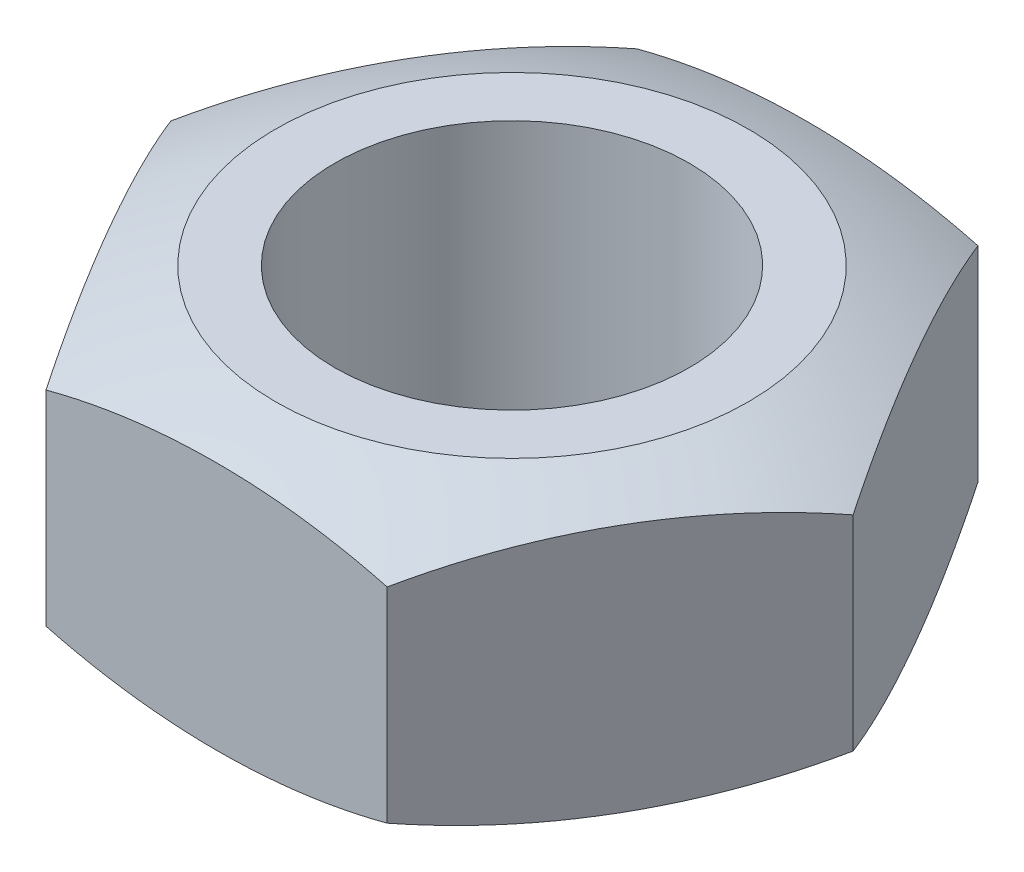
ISO-10303-21;
HEADER;
FILE_DESCRIPTION(('STEP AP214'),'2;1');
FILE_NAME('part.step','',(''),(''),'','','');
FILE_SCHEMA(('AUTOMOTIVE_DESIGN { 1 0 10303 214 1 1 1 1 }'));
ENDSEC;
DATA;
#1=APPLICATION_CONTEXT('core data for automotive mechanical design processes');
#2=APPLICATION_PROTOCOL_DEFINITION('international standard','automotive_design',2000,#1);
#3=PRODUCT_CONTEXT('',#1,'mechanical');
#4=PRODUCT('Part','Part','',(#3));
#5=PRODUCT_RELATED_PRODUCT_CATEGORY('part','',(#4));
#6=PRODUCT_DEFINITION_FORMATION('','',#4);
#7=PRODUCT_DEFINITION_CONTEXT('part definition',#1,'design');
#8=PRODUCT_DEFINITION('design','',#6,#7);
#9=PRODUCT_DEFINITION_SHAPE('','',#8);
#10=(LENGTH_UNIT() NAMED_UNIT(*) SI_UNIT(.MILLI.,.METRE.));
#11=(NAMED_UNIT(*) PLANE_ANGLE_UNIT() SI_UNIT($,.RADIAN.));
#12=(NAMED_UNIT(*) SI_UNIT($,.STERADIAN.) SOLID_ANGLE_UNIT());
#13=UNCERTAINTY_MEASURE_WITH_UNIT(LENGTH_MEASURE(1.E-05),#10,'distance_accuracy_value','');
#14=(GEOMETRIC_REPRESENTATION_CONTEXT(3) GLOBAL_UNCERTAINTY_ASSIGNED_CONTEXT((#13)) GLOBAL_UNIT_ASSIGNED_CONTEXT((#10,
#11,#12)) REPRESENTATION_CONTEXT('',''));
#15=CARTESIAN_POINT('',(0.,0.,0.));
#16=DIRECTION('',(0.,0.,1.));
#17=DIRECTION('',(1.,0.,0.));
#18=AXIS2_PLACEMENT_3D('',#15,#16,#17);
#19=CARTESIAN_POINT('',(5.77350269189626,5.,0.));
#20=DIRECTION('',(0.,1.,0.));
#21=DIRECTION('',(0.,0.,1.));
#22=AXIS2_PLACEMENT_3D('',#19,#20,#21);
#23=PLANE('',#22);
#24=CARTESIAN_POINT('',(0.,5.,0.));
#25=DIRECTION('',(0.,1.,0.));
#26=DIRECTION('',(0.,0.,1.));
#27=AXIS2_PLACEMENT_3D('',#24,#25,#26);
#28=CIRCLE('',#27,4.);
#29=CARTESIAN_POINT('',(0.,5.,4.));
#30=VERTEX_POINT('',#29);
#31=EDGE_CURVE('E40',#30,#30,#28,.F.);
#32=ORIENTED_EDGE('',*,*,#31,.F.);
#33=EDGE_LOOP('',(#32));
#34=FACE_BOUND('',#33,.T.);
#35=CARTESIAN_POINT('',(0.,5.,0.));
#36=DIRECTION('',(0.,1.,0.));
#37=DIRECTION('',(0.,0.,1.));
#38=AXIS2_PLACEMENT_3D('',#35,#36,#37);
#39=CIRCLE('',#38,3.);
#40=CARTESIAN_POINT('',(0.,5.,3.));
#41=VERTEX_POINT('',#40);
#42=EDGE_CURVE('E142',#41,#41,#39,.T.);
#43=ORIENTED_EDGE('',*,*,#42,.F.);
#44=EDGE_LOOP('',(#43));
#45=FACE_BOUND('',#44,.T.);
#46=ADVANCED_FACE('F36',(#34,#45),#23,.T.);
#47=CARTESIAN_POINT('',(5.77350269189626,0.,0.));
#48=DIRECTION('',(0.,1.,0.));
#49=DIRECTION('',(0.,0.,1.));
#50=AXIS2_PLACEMENT_3D('',#47,#48,#49);
#51=PLANE('',#50);
#52=CARTESIAN_POINT('',(0.,0.,0.));
#53=DIRECTION('',(0.,1.,0.));
#54=DIRECTION('',(0.,0.,1.));
#55=AXIS2_PLACEMENT_3D('',#52,#53,#54);
#56=CIRCLE('',#55,4.);
#57=CARTESIAN_POINT('',(0.,0.,4.));
#58=VERTEX_POINT('',#57);
#59=EDGE_CURVE('E114',#58,#58,#56,.F.);
#60=ORIENTED_EDGE('',*,*,#59,.T.);
#61=EDGE_LOOP('',(#60));
#62=FACE_BOUND('',#61,.T.);
#63=CARTESIAN_POINT('',(0.,0.,0.));
#64=DIRECTION('',(0.,1.,0.));
#65=DIRECTION('',(0.,0.,1.));
#66=AXIS2_PLACEMENT_3D('',#63,#64,#65);
#67=CIRCLE('',#66,3.);
#68=CARTESIAN_POINT('',(0.,0.,3.));
#69=VERTEX_POINT('',#68);
#70=EDGE_CURVE('E143',#69,#69,#67,.T.);
#71=ORIENTED_EDGE('',*,*,#70,.T.);
#72=EDGE_LOOP('',(#71));
#73=FACE_BOUND('',#72,.T.);
#74=ADVANCED_FACE('F172',(#62,#73),#51,.F.);
#75=CARTESIAN_POINT('',(0.,0.,0.));
#76=DIRECTION('',(0.,1.,0.));
#77=DIRECTION('',(0.,0.,1.));
#78=AXIS2_PLACEMENT_3D('',#75,#76,#77);
#79=CYLINDRICAL_SURFACE('',#78,3.);
#80=ORIENTED_EDGE('',*,*,#70,.F.);
#81=EDGE_LOOP('',(#80));
#82=FACE_BOUND('',#81,.T.);
#83=ORIENTED_EDGE('',*,*,#42,.T.);
#84=EDGE_LOOP('',(#83));
#85=FACE_BOUND('',#84,.T.);
#86=ADVANCED_FACE('F178',(#82,#85),#79,.F.);
#87=CARTESIAN_POINT('',(0.,11.6575133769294,0.));
#88=DIRECTION('',(0.,-1.,0.));
#89=DIRECTION('',(1.,0.,0.));
#90=AXIS2_PLACEMENT_3D('',#87,#88,#89);
#91=SPHERICAL_SURFACE('',#90,12.3246751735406);
#92=ORIENTED_EDGE('',*,*,#59,.F.);
#93=EDGE_LOOP('',(#92));
#94=FACE_BOUND('',#93,.T.);
#95=CARTESIAN_POINT('',(0.,11.6575133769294,5.));
#96=DIRECTION('',(0.,0.,-1.));
#97=DIRECTION('',(-1.,0.,0.));
#98=AXIS2_PLACEMENT_3D('',#95,#96,#97);
#99=CIRCLE('',#98,11.2648842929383);
#100=CARTESIAN_POINT('',(-2.88675134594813,0.768790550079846,5.));
#101=VERTEX_POINT('',#100);
#102=CARTESIAN_POINT('',(2.88675134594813,0.768790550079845,5.));
#103=VERTEX_POINT('',#102);
#104=EDGE_CURVE('E116',#101,#103,#99,.F.);
#105=ORIENTED_EDGE('',*,*,#104,.F.);
#106=CARTESIAN_POINT('',(-4.33012701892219,11.6575133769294,2.5));
#107=DIRECTION('',(0.866025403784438,0.,-0.5));
#108=DIRECTION('',(-0.5,0.,-0.866025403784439));
#109=AXIS2_PLACEMENT_3D('',#106,#107,#108);
#110=CIRCLE('',#109,11.2648842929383);
#111=CARTESIAN_POINT('',(-5.77350269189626,0.768790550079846,0.));
#112=VERTEX_POINT('',#111);
#113=EDGE_CURVE('E119',#112,#101,#110,.F.);
#114=ORIENTED_EDGE('',*,*,#113,.F.);
#115=CARTESIAN_POINT('',(-4.33012701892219,11.6575133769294,-2.5));
#116=DIRECTION('',(0.866025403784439,0.,0.5));
#117=DIRECTION('',(0.5,0.,-0.866025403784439));
#118=AXIS2_PLACEMENT_3D('',#115,#116,#117);
#119=CIRCLE('',#118,11.2648842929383);
#120=CARTESIAN_POINT('',(-2.88675134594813,0.768790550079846,-5.00000000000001));
#121=VERTEX_POINT('',#120);
#122=EDGE_CURVE('E94',#121,#112,#119,.F.);
#123=ORIENTED_EDGE('',*,*,#122,.F.);
#124=CARTESIAN_POINT('',(0.,11.6575133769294,-5.));
#125=DIRECTION('',(0.,0.,1.));
#126=DIRECTION('',(1.,0.,0.));
#127=AXIS2_PLACEMENT_3D('',#124,#125,#126);
#128=CIRCLE('',#127,11.2648842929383);
#129=CARTESIAN_POINT('',(2.88675134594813,0.768790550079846,-5.));
#130=VERTEX_POINT('',#129);
#131=EDGE_CURVE('E89',#130,#121,#128,.F.);
#132=ORIENTED_EDGE('',*,*,#131,.F.);
#133=CARTESIAN_POINT('',(4.33012701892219,11.6575133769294,-2.5));
#134=DIRECTION('',(-0.866025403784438,0.,0.5));
#135=DIRECTION('',(0.5,0.,0.866025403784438));
#136=AXIS2_PLACEMENT_3D('',#133,#134,#135);
#137=CIRCLE('',#136,11.2648842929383);
#138=CARTESIAN_POINT('',(5.77350269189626,0.768790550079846,0.));
#139=VERTEX_POINT('',#138);
#140=EDGE_CURVE('E92',#139,#130,#137,.F.);
#141=ORIENTED_EDGE('',*,*,#140,.F.);
#142=CARTESIAN_POINT('',(4.33012701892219,11.6575133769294,2.5));
#143=DIRECTION('',(-0.866025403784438,0.,-0.5));
#144=DIRECTION('',(-0.5,0.,0.866025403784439));
#145=AXIS2_PLACEMENT_3D('',#142,#143,#144);
#146=CIRCLE('',#145,11.2648842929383);
#147=EDGE_CURVE('E61',#103,#139,#146,.F.);
#148=ORIENTED_EDGE('',*,*,#147,.F.);
#149=EDGE_LOOP('',(#105,#114,#123,#132,#141,#148));
#150=FACE_BOUND('',#149,.T.);
#151=ADVANCED_FACE('F91',(#94,#150),#91,.T.);
#152=CARTESIAN_POINT('',(0.,-6.6575133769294,0.));
#153=DIRECTION('',(0.,-1.,0.));
#154=DIRECTION('',(1.,0.,0.));
#155=AXIS2_PLACEMENT_3D('',#152,#153,#154);
#156=SPHERICAL_SURFACE('',#155,12.3246751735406);
#157=ORIENTED_EDGE('',*,*,#31,.T.);
#158=EDGE_LOOP('',(#157));
#159=FACE_BOUND('',#158,.T.);
#160=CARTESIAN_POINT('',(4.33012701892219,-6.6575133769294,-2.5));
#161=DIRECTION('',(-0.866025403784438,0.,0.5));
#162=DIRECTION('',(0.5,0.,0.866025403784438));
#163=AXIS2_PLACEMENT_3D('',#160,#161,#162);
#164=CIRCLE('',#163,11.2648842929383);
#165=CARTESIAN_POINT('',(2.88675134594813,4.23120944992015,-5.));
#166=VERTEX_POINT('',#165);
#167=CARTESIAN_POINT('',(5.77350269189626,4.23120944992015,0.));
#168=VERTEX_POINT('',#167);
#169=EDGE_CURVE('E137',#166,#168,#164,.F.);
#170=ORIENTED_EDGE('',*,*,#169,.F.);
#171=CARTESIAN_POINT('',(0.,-6.6575133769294,-5.));
#172=DIRECTION('',(0.,0.,1.));
#173=DIRECTION('',(1.,0.,0.));
#174=AXIS2_PLACEMENT_3D('',#171,#172,#173);
#175=CIRCLE('',#174,11.2648842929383);
#176=CARTESIAN_POINT('',(-2.88675134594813,4.23120944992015,-5.));
#177=VERTEX_POINT('',#176);
#178=EDGE_CURVE('E108',#177,#166,#175,.F.);
#179=ORIENTED_EDGE('',*,*,#178,.F.);
#180=CARTESIAN_POINT('',(-4.33012701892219,-6.6575133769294,-2.5));
#181=DIRECTION('',(0.866025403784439,0.,0.5));
#182=DIRECTION('',(0.5,0.,-0.866025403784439));
#183=AXIS2_PLACEMENT_3D('',#180,#181,#182);
#184=CIRCLE('',#183,11.2648842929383);
#185=CARTESIAN_POINT('',(-5.77350269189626,4.23120944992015,0.));
#186=VERTEX_POINT('',#185);
#187=EDGE_CURVE('E133',#186,#177,#184,.F.);
#188=ORIENTED_EDGE('',*,*,#187,.F.);
#189=CARTESIAN_POINT('',(-4.33012701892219,-6.6575133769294,2.5));
#190=DIRECTION('',(0.866025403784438,0.,-0.5));
#191=DIRECTION('',(-0.5,0.,-0.866025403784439));
#192=AXIS2_PLACEMENT_3D('',#189,#190,#191);
#193=CIRCLE('',#192,11.2648842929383);
#194=CARTESIAN_POINT('',(-2.88675134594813,4.23120944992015,5.));
#195=VERTEX_POINT('',#194);
#196=EDGE_CURVE('E53',#195,#186,#193,.F.);
#197=ORIENTED_EDGE('',*,*,#196,.F.);
#198=CARTESIAN_POINT('',(0.,-6.6575133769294,5.));
#199=DIRECTION('',(0.,0.,-1.));
#200=DIRECTION('',(-1.,0.,0.));
#201=AXIS2_PLACEMENT_3D('',#198,#199,#200);
#202=CIRCLE('',#201,11.2648842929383);
#203=CARTESIAN_POINT('',(2.88675134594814,4.23120944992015,5.));
#204=VERTEX_POINT('',#203);
#205=EDGE_CURVE('E130',#204,#195,#202,.F.);
#206=ORIENTED_EDGE('',*,*,#205,.F.);
#207=CARTESIAN_POINT('',(4.33012701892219,-6.6575133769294,2.5));
#208=DIRECTION('',(-0.866025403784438,0.,-0.5));
#209=DIRECTION('',(-0.5,0.,0.866025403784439));
#210=AXIS2_PLACEMENT_3D('',#207,#208,#209);
#211=CIRCLE('',#210,11.2648842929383);
#212=EDGE_CURVE('E139',#168,#204,#211,.F.);
#213=ORIENTED_EDGE('',*,*,#212,.F.);
#214=EDGE_LOOP('',(#170,#179,#188,#197,#206,#213));
#215=FACE_BOUND('',#214,.T.);
#216=ADVANCED_FACE('F158',(#159,#215),#156,.T.);
#217=CARTESIAN_POINT('',(-2.88675134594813,5.,5.));
#218=DIRECTION('',(0.,0.,-1.));
#219=DIRECTION('',(-1.,0.,0.));
#220=AXIS2_PLACEMENT_3D('',#217,#218,#219);
#221=PLANE('',#220);
#222=DIRECTION('',(0.,-1.,0.));
#223=VECTOR('',#222,1.);
#224=CARTESIAN_POINT('',(2.88675134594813,5.,5.));
#225=LINE('',#224,#223);
#226=EDGE_CURVE('E146',#204,#103,#225,.T.);
#227=ORIENTED_EDGE('',*,*,#226,.F.);
#228=ORIENTED_EDGE('',*,*,#205,.T.);
#229=DIRECTION('',(0.,-1.,0.));
#230=VECTOR('',#229,1.);
#231=CARTESIAN_POINT('',(-2.88675134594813,5.,5.));
#232=LINE('',#231,#230);
#233=EDGE_CURVE('E150',#195,#101,#232,.T.);
#234=ORIENTED_EDGE('',*,*,#233,.T.);
#235=ORIENTED_EDGE('',*,*,#104,.T.);
#236=EDGE_LOOP('',(#227,#228,#234,#235));
#237=FACE_BOUND('',#236,.T.);
#238=ADVANCED_FACE('F160',(#237),#221,.F.);
#239=CARTESIAN_POINT('',(-5.77350269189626,5.,0.));
#240=DIRECTION('',(0.866025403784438,0.,-0.5));
#241=DIRECTION('',(-0.5,0.,-0.866025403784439));
#242=AXIS2_PLACEMENT_3D('',#239,#240,#241);
#243=PLANE('',#242);
#244=ORIENTED_EDGE('',*,*,#233,.F.);
#245=ORIENTED_EDGE('',*,*,#196,.T.);
#246=DIRECTION('',(0.,-1.,0.));
#247=VECTOR('',#246,1.);
#248=CARTESIAN_POINT('',(-5.77350269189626,5.,0.));
#249=LINE('',#248,#247);
#250=EDGE_CURVE('E111',#186,#112,#249,.T.);
#251=ORIENTED_EDGE('',*,*,#250,.T.);
#252=ORIENTED_EDGE('',*,*,#113,.T.);
#253=EDGE_LOOP('',(#244,#245,#251,#252));
#254=FACE_BOUND('',#253,.T.);
#255=ADVANCED_FACE('F155',(#254),#243,.F.);
#256=CARTESIAN_POINT('',(-2.88675134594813,5.,-5.));
#257=DIRECTION('',(0.866025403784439,0.,0.5));
#258=DIRECTION('',(0.5,0.,-0.866025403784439));
#259=AXIS2_PLACEMENT_3D('',#256,#257,#258);
#260=PLANE('',#259);
#261=ORIENTED_EDGE('',*,*,#250,.F.);
#262=ORIENTED_EDGE('',*,*,#187,.T.);
#263=DIRECTION('',(0.,-1.,0.));
#264=VECTOR('',#263,1.);
#265=CARTESIAN_POINT('',(-2.88675134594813,5.,-5.));
#266=LINE('',#265,#264);
#267=EDGE_CURVE('E109',#177,#121,#266,.T.);
#268=ORIENTED_EDGE('',*,*,#267,.T.);
#269=ORIENTED_EDGE('',*,*,#122,.T.);
#270=EDGE_LOOP('',(#261,#262,#268,#269));
#271=FACE_BOUND('',#270,.T.);
#272=ADVANCED_FACE('F157',(#271),#260,.F.);
#273=CARTESIAN_POINT('',(2.88675134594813,5.,-5.));
#274=DIRECTION('',(0.,0.,1.));
#275=DIRECTION('',(1.,0.,0.));
#276=AXIS2_PLACEMENT_3D('',#273,#274,#275);
#277=PLANE('',#276);
#278=ORIENTED_EDGE('',*,*,#267,.F.);
#279=ORIENTED_EDGE('',*,*,#178,.T.);
#280=DIRECTION('',(0.,-1.,0.));
#281=VECTOR('',#280,1.);
#282=CARTESIAN_POINT('',(2.88675134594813,5.,-5.));
#283=LINE('',#282,#281);
#284=EDGE_CURVE('E45',#166,#130,#283,.T.);
#285=ORIENTED_EDGE('',*,*,#284,.T.);
#286=ORIENTED_EDGE('',*,*,#131,.T.);
#287=EDGE_LOOP('',(#278,#279,#285,#286));
#288=FACE_BOUND('',#287,.T.);
#289=ADVANCED_FACE('F107',(#288),#277,.F.);
#290=CARTESIAN_POINT('',(5.77350269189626,5.,0.));
#291=DIRECTION('',(-0.866025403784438,0.,0.5));
#292=DIRECTION('',(0.5,0.,0.866025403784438));
#293=AXIS2_PLACEMENT_3D('',#290,#291,#292);
#294=PLANE('',#293);
#295=ORIENTED_EDGE('',*,*,#284,.F.);
#296=ORIENTED_EDGE('',*,*,#169,.T.);
#297=DIRECTION('',(0.,-1.,0.));
#298=VECTOR('',#297,1.);
#299=CARTESIAN_POINT('',(5.77350269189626,5.,0.));
#300=LINE('',#299,#298);
#301=EDGE_CURVE('E11',#168,#139,#300,.T.);
#302=ORIENTED_EDGE('',*,*,#301,.T.);
#303=ORIENTED_EDGE('',*,*,#140,.T.);
#304=EDGE_LOOP('',(#295,#296,#302,#303));
#305=FACE_BOUND('',#304,.T.);
#306=ADVANCED_FACE('F102',(#305),#294,.F.);
#307=CARTESIAN_POINT('',(2.88675134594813,5.,5.));
#308=DIRECTION('',(-0.866025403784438,0.,-0.5));
#309=DIRECTION('',(-0.5,0.,0.866025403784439));
#310=AXIS2_PLACEMENT_3D('',#307,#308,#309);
#311=PLANE('',#310);
#312=ORIENTED_EDGE('',*,*,#301,.F.);
#313=ORIENTED_EDGE('',*,*,#212,.T.);
#314=ORIENTED_EDGE('',*,*,#226,.T.);
#315=ORIENTED_EDGE('',*,*,#147,.T.);
#316=EDGE_LOOP('',(#312,#313,#314,#315));
#317=FACE_BOUND('',#316,.T.);
#318=ADVANCED_FACE('F38',(#317),#311,.F.);
#319=CLOSED_SHELL('',(#46,#74,#86,#151,#216,#238,#255,#272,#289,#306,#318));
#320=MANIFOLD_SOLID_BREP('B2',#319);
#321=ADVANCED_BREP_SHAPE_REPRESENTATION('',(#18,#320),#14);
#322=SHAPE_DEFINITION_REPRESENTATION(#9,#321);
ENDSEC;
END-ISO-10303-21;
